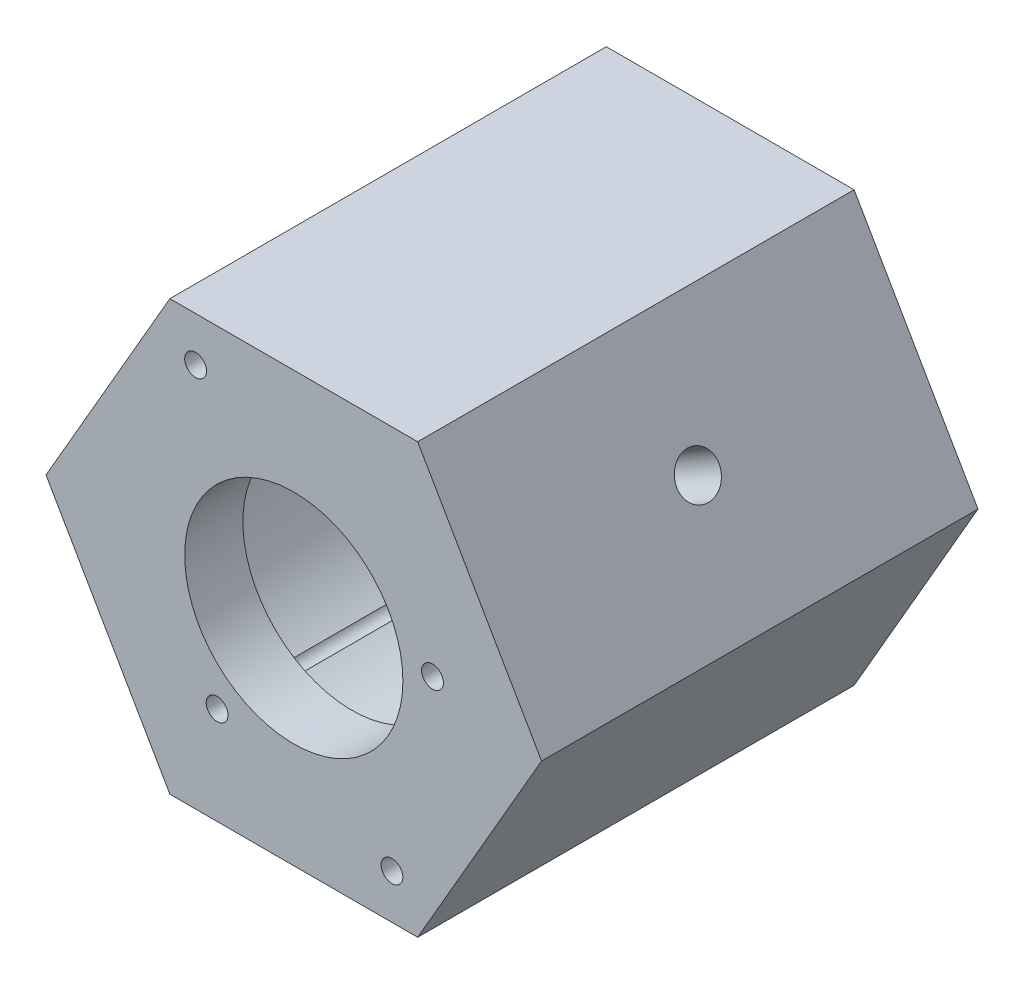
ISO-10303-21;
HEADER;
FILE_DESCRIPTION(('STEP AP214'),'2;1');
FILE_NAME('part.step','',(''),(''),'','','');
FILE_SCHEMA(('AUTOMOTIVE_DESIGN { 1 0 10303 214 1 1 1 1 }'));
ENDSEC;
DATA;
#1=APPLICATION_CONTEXT('core data for automotive mechanical design processes');
#2=APPLICATION_PROTOCOL_DEFINITION('international standard','automotive_design',2000,#1);
#3=PRODUCT_CONTEXT('',#1,'mechanical');
#4=PRODUCT('Part','Part','',(#3));
#5=PRODUCT_RELATED_PRODUCT_CATEGORY('part','',(#4));
#6=PRODUCT_DEFINITION_FORMATION('','',#4);
#7=PRODUCT_DEFINITION_CONTEXT('part definition',#1,'design');
#8=PRODUCT_DEFINITION('design','',#6,#7);
#9=PRODUCT_DEFINITION_SHAPE('','',#8);
#10=(LENGTH_UNIT() NAMED_UNIT(*) SI_UNIT(.MILLI.,.METRE.));
#11=(NAMED_UNIT(*) PLANE_ANGLE_UNIT() SI_UNIT($,.RADIAN.));
#12=(NAMED_UNIT(*) SI_UNIT($,.STERADIAN.) SOLID_ANGLE_UNIT());
#13=UNCERTAINTY_MEASURE_WITH_UNIT(LENGTH_MEASURE(1.E-05),#10,'distance_accuracy_value','');
#14=(GEOMETRIC_REPRESENTATION_CONTEXT(3) GLOBAL_UNCERTAINTY_ASSIGNED_CONTEXT((#13)) GLOBAL_UNIT_ASSIGNED_CONTEXT((#10,
#11,#12)) REPRESENTATION_CONTEXT('',''));
#15=CARTESIAN_POINT('',(0.,0.,0.));
#16=DIRECTION('',(0.,0.,1.));
#17=DIRECTION('',(1.,0.,0.));
#18=AXIS2_PLACEMENT_3D('',#15,#16,#17);
#19=CARTESIAN_POINT('',(0.,0.,30.));
#20=DIRECTION('',(0.,0.,-1.));
#21=DIRECTION('',(-1.,0.,0.));
#22=AXIS2_PLACEMENT_3D('',#19,#20,#21);
#23=CYLINDRICAL_SURFACE('',#22,20.5);
#24=DIRECTION('',(0.,0.,1.));
#25=VECTOR('',#24,1.);
#26=CARTESIAN_POINT('',(-11.928775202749,-16.6719621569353,0.));
#27=LINE('',#26,#25);
#28=CARTESIAN_POINT('',(-11.928775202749,-16.6719621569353,-30.));
#29=VERTEX_POINT('',#28);
#30=CARTESIAN_POINT('',(-11.928775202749,-16.6719621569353,22.));
#31=VERTEX_POINT('',#30);
#32=EDGE_CURVE('E47',#29,#31,#27,.T.);
#33=ORIENTED_EDGE('',*,*,#32,.F.);
#34=CARTESIAN_POINT('',(0.,0.,-30.));
#35=DIRECTION('',(0.,0.,1.));
#36=DIRECTION('',(1.,0.,0.));
#37=AXIS2_PLACEMENT_3D('',#34,#35,#36);
#38=CIRCLE('',#37,20.5);
#39=CARTESIAN_POINT('',(20.1888763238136,3.55798718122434,-30.));
#40=VERTEX_POINT('',#39);
#41=EDGE_CURVE('E122',#40,#29,#38,.T.);
#42=ORIENTED_EDGE('',*,*,#41,.F.);
#43=DIRECTION('',(0.,0.,1.));
#44=VECTOR('',#43,1.);
#45=CARTESIAN_POINT('',(20.1888763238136,3.55798718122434,0.));
#46=LINE('',#45,#44);
#47=CARTESIAN_POINT('',(20.1888763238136,3.55798718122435,22.));
#48=VERTEX_POINT('',#47);
#49=EDGE_CURVE('E323',#48,#40,#46,.F.);
#50=ORIENTED_EDGE('',*,*,#49,.F.);
#51=CARTESIAN_POINT('',(0.,0.,22.));
#52=DIRECTION('',(0.,0.,1.));
#53=DIRECTION('',(1.,0.,0.));
#54=AXIS2_PLACEMENT_3D('',#51,#52,#53);
#55=CIRCLE('',#54,20.5);
#56=EDGE_CURVE('E124',#48,#31,#55,.T.);
#57=ORIENTED_EDGE('',*,*,#56,.T.);
#58=EDGE_LOOP('',(#33,#42,#50,#57));
#59=FACE_BOUND('',#58,.T.);
#60=CARTESIAN_POINT('',(16.1249822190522,12.6583943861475,0.));
#61=CARTESIAN_POINT('',(16.1249878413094,12.6583898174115,-0.162017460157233));
#62=CARTESIAN_POINT('',(16.1334923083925,12.6475768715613,-0.324131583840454));
#63=CARTESIAN_POINT('',(16.167138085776,12.6045374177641,-0.643834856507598));
#64=CARTESIAN_POINT('',(16.1922960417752,12.5722894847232,-0.801419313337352));
#65=CARTESIAN_POINT('',(16.2580676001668,12.4871179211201,-1.10738893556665));
#66=CARTESIAN_POINT('',(16.2986698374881,12.4342094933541,-1.2557807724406));
#67=CARTESIAN_POINT('',(16.3935179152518,12.3088877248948,-1.53933958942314));
#68=CARTESIAN_POINT('',(16.447761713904,12.2364773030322,-1.67450854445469));
#69=CARTESIAN_POINT('',(16.5679837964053,12.073202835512,-1.92877222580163));
#70=CARTESIAN_POINT('',(16.6340347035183,11.9822240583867,-2.04775895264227));
#71=CARTESIAN_POINT('',(16.7749519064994,11.7841305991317,-2.265345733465));
#72=CARTESIAN_POINT('',(16.8498186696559,11.6770150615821,-2.36394470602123));
#73=CARTESIAN_POINT('',(17.0058126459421,11.4486466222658,-2.53835192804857));
#74=CARTESIAN_POINT('',(17.0869651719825,11.3273354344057,-2.61406129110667));
#75=CARTESIAN_POINT('',(17.2522555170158,11.0739574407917,-2.73990604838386));
#76=CARTESIAN_POINT('',(17.3363931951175,10.9418911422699,-2.79004264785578));
#77=CARTESIAN_POINT('',(17.5041780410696,10.6714056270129,-2.86299285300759));
#78=CARTESIAN_POINT('',(17.5878247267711,10.5330347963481,-2.88598692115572));
#79=CARTESIAN_POINT('',(17.7525494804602,10.252968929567,-2.90455930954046));
#80=CARTESIAN_POINT('',(17.833627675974,10.1112740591,-2.90013899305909));
#81=CARTESIAN_POINT('',(17.9903615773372,9.82968366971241,-2.86415129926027));
#82=CARTESIAN_POINT('',(18.0660518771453,9.68978252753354,-2.83277804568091));
#83=CARTESIAN_POINT('',(18.2108269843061,9.41487816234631,-2.74407930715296));
#84=CARTESIAN_POINT('',(18.2799116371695,9.27987505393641,-2.68675321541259));
#85=CARTESIAN_POINT('',(18.4103280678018,9.01838472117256,-2.54757457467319));
#86=CARTESIAN_POINT('',(18.4716327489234,8.89192794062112,-2.46563947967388));
#87=CARTESIAN_POINT('',(18.5852619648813,8.65191867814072,-2.27962885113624));
#88=CARTESIAN_POINT('',(18.6375859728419,8.53836695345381,-2.17555201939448));
#89=CARTESIAN_POINT('',(18.7330641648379,8.3268193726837,-1.94712871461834));
#90=CARTESIAN_POINT('',(18.776134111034,8.22896831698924,-1.82261285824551));
#91=CARTESIAN_POINT('',(18.8521626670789,8.05326990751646,-1.5574238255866));
#92=CARTESIAN_POINT('',(18.8851212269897,7.97542265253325,-1.41675056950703));
#93=CARTESIAN_POINT('',(18.9407633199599,7.84236664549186,-1.12307451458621));
#94=CARTESIAN_POINT('',(18.9634402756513,7.7871723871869,-0.970063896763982));
#95=CARTESIAN_POINT('',(18.9984041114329,7.70148058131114,-0.65614503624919));
#96=CARTESIAN_POINT('',(19.0106916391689,7.67098149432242,-0.495237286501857));
#97=CARTESIAN_POINT('',(19.0247868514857,7.63595732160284,-0.171578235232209));
#98=CARTESIAN_POINT('',(19.0266840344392,7.63121041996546,-0.00885481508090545));
#99=CARTESIAN_POINT('',(19.0202352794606,7.64726891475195,0.315117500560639));
#100=CARTESIAN_POINT('',(19.0118896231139,7.66807360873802,0.476366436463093));
#101=CARTESIAN_POINT('',(18.985034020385,7.73432210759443,0.792087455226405));
#102=CARTESIAN_POINT('',(18.9665690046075,7.77965698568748,0.946586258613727));
#103=CARTESIAN_POINT('',(18.9195609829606,7.89328640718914,1.24526157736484));
#104=CARTESIAN_POINT('',(18.8910175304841,7.96158196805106,1.38943763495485));
#105=CARTESIAN_POINT('',(18.8237562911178,8.11933329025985,1.66444012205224));
#106=CARTESIAN_POINT('',(18.7849714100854,8.20892818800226,1.79517031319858));
#107=CARTESIAN_POINT('',(18.6975874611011,8.40605843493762,2.03858346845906));
#108=CARTESIAN_POINT('',(18.6489879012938,8.51359468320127,2.15126552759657));
#109=CARTESIAN_POINT('',(18.5420714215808,8.74401543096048,2.35622766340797));
#110=CARTESIAN_POINT('',(18.483685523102,8.86700720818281,2.44835125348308));
#111=CARTESIAN_POINT('',(18.3582809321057,9.12381010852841,2.60849385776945));
#112=CARTESIAN_POINT('',(18.2912624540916,9.25762096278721,2.67651347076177));
#113=CARTESIAN_POINT('',(18.1500746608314,9.53144366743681,2.78626421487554));
#114=CARTESIAN_POINT('',(18.0759300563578,9.67143323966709,2.82808266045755));
#115=CARTESIAN_POINT('',(17.9220043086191,9.95377303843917,2.88452714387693));
#116=CARTESIAN_POINT('',(17.8422234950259,10.0961231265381,2.89915477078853));
#117=CARTESIAN_POINT('',(17.6798971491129,10.3777369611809,2.90076689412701));
#118=CARTESIAN_POINT('',(17.5973818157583,10.5170168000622,2.88799148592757));
#119=CARTESIAN_POINT('',(17.4314146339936,10.7898698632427,2.83567260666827));
#120=CARTESIAN_POINT('',(17.3479627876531,10.9234431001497,2.7961291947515));
#121=CARTESIAN_POINT('',(17.1829146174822,11.181273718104,2.69147853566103));
#122=CARTESIAN_POINT('',(17.1013172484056,11.3055364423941,2.62638608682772));
#123=CARTESIAN_POINT('',(16.9427898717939,11.5417559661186,2.47251032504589));
#124=CARTESIAN_POINT('',(16.8658599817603,11.6537124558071,2.38372641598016));
#125=CARTESIAN_POINT('',(16.7189091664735,11.8635850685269,2.18411221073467));
#126=CARTESIAN_POINT('',(16.6489512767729,11.9613761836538,2.0731040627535));
#127=CARTESIAN_POINT('',(16.5194494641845,12.1396028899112,1.83256600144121));
#128=CARTESIAN_POINT('',(16.4599079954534,12.2200343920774,1.70303173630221));
#129=CARTESIAN_POINT('',(16.3534923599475,12.3620883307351,1.42836746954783));
#130=CARTESIAN_POINT('',(16.3066825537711,12.4236153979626,1.283163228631));
#131=CARTESIAN_POINT('',(16.2282530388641,12.5258929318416,0.981870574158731));
#132=CARTESIAN_POINT('',(16.1966172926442,12.5666653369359,0.825793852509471));
#133=CARTESIAN_POINT('',(16.1572956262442,12.6171487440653,0.557479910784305));
#134=CARTESIAN_POINT('',(16.1452050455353,12.6325978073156,0.44691349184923));
#135=CARTESIAN_POINT('',(16.1290464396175,12.6532221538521,0.224246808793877));
#136=CARTESIAN_POINT('',(16.1249783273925,12.6583975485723,0.112146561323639));
#137=CARTESIAN_POINT('',(16.1249822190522,12.6583943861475,0.));
#138=B_SPLINE_CURVE_WITH_KNOTS('',3,(#60,#61,#62,#63,#64,#65,#66,#67,#68,#69,#70,#71,#72,#73,
#74,#75,#76,#77,#78,#79,#80,#81,#82,#83,#84,#85,#86,#87,#88,#89,#90,#91,#92,#93,#94,#95,#96,#97,
#98,#99,#100,#101,#102,#103,#104,#105,#106,#107,#108,#109,#110,#111,#112,#113,#114,#115,#116,
#117,#118,#119,#120,#121,#122,#123,#124,#125,#126,#127,#128,#129,#130,#131,#132,#133,#134,#135,
#136,#137),.UNSPECIFIED.,.T.,.F.,(4,2,2,2,2,2,2,2,2,2,2,2,2,2,2,2,2,2,2,2,2,2,2,2,2,2,2,2,2,2,2,
2,2,2,2,2,2,2,4),(0.,0.485642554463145,0.971771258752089,1.45754292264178,1.94324192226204,
2.43203815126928,2.92086030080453,3.41176501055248,3.90264658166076,4.39024571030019,
4.87782059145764,5.36191296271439,5.84601665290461,6.33176266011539,6.81753715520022,
7.30756197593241,7.79758921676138,8.28792949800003,8.77823921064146,9.2643188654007,
9.75038515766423,10.2343105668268,10.7182574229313,11.205456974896,11.692680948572,
12.1834958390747,12.6742985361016,13.1634568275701,13.6525865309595,14.1374481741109,
14.6223087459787,15.1068888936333,15.5914812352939,16.0801188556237,16.5688714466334,
17.0600506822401,17.5507096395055,17.8868692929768,18.2230253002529),.UNSPECIFIED.);
#139=CARTESIAN_POINT('',(16.1249822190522,12.6583943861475,0.));
#140=VERTEX_POINT('',#139);
#141=EDGE_CURVE('E181',#140,#140,#138,.T.);
#142=ORIENTED_EDGE('',*,*,#141,.F.);
#143=EDGE_LOOP('',(#142));
#144=FACE_BOUND('',#143,.T.);
#145=CARTESIAN_POINT('',(-19.0249822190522,-7.63544704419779,0.));
#146=CARTESIAN_POINT('',(-19.0249810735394,-7.63545419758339,0.162017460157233));
#147=CARTESIAN_POINT('',(-19.0198690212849,-7.6482257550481,0.324131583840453));
#148=CARTESIAN_POINT('',(-18.9994186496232,-7.6988835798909,0.643834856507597));
#149=CARTESIAN_POINT('',(-18.9840700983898,-7.7367949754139,0.801419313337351));
#150=CARTESIAN_POINT('',(-18.9431951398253,-7.83634059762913,1.10738893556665));
#151=CARTESIAN_POINT('',(-18.9176762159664,-7.8979573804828,1.2557807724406));
#152=CARTESIAN_POINT('',(-18.8565684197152,-8.04275910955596,1.53933958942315));
#153=CARTESIAN_POINT('',(-18.8209810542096,-8.12594082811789,1.67450854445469));
#154=CARTESIAN_POINT('',(-18.7396922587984,-8.3116934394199,1.92877222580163));
#155=CARTESIAN_POINT('',(-18.6939277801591,-8.41438459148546,2.04775895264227));
#156=CARTESIAN_POINT('',(-18.5928324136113,-8.63546919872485,2.265345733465));
#157=CARTESIAN_POINT('',(-18.5375010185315,-8.75386348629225,2.36394470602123));
#158=CARTESIAN_POINT('',(-18.4177251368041,-9.00314245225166,2.53835192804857));
#159=CARTESIAN_POINT('',(-18.3532428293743,-9.13407819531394,2.61406129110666));
#160=CARTESIAN_POINT('',(-18.2164562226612,-9.40391282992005,2.73990604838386));
#161=CARTESIAN_POINT('',(-18.1441522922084,-9.54281134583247,2.79004264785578));
#162=CARTESIAN_POINT('',(-17.9937973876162,-9.82336004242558,2.86299285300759));
#163=CARTESIAN_POINT('',(-17.9157880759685,-9.96498561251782,2.88598692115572));
#164=CARTESIAN_POINT('',(-17.7556062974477,-10.2476743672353,2.90455930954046));
#165=CARTESIAN_POINT('',(-17.6734340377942,-10.3887375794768,2.90013899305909));
#166=CARTESIAN_POINT('',(-17.5079365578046,-10.6652683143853,2.86415129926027));
#167=CARTESIAN_POINT('',(-17.4246237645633,-10.8007686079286,2.83277804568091));
#168=CARTESIAN_POINT('',(-17.2589371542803,-11.0635997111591,2.74407930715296));
#169=CARTESIAN_POINT('',(-17.1765633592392,-11.1909303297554,2.68675321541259));
#170=CARTESIAN_POINT('',(-17.0153143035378,-11.4346194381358,2.54757457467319));
#171=CARTESIAN_POINT('',(-16.9364518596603,-11.5509392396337,2.46563947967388));
#172=CARTESIAN_POINT('',(-16.7854123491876,-11.7693496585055,2.27962885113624));
#173=CARTESIAN_POINT('',(-16.7132356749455,-11.8714394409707,2.17555201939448));
#174=CARTESIAN_POINT('',(-16.5777691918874,-12.0598997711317,1.94712871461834));
#175=CARTESIAN_POINT('',(-16.5145626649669,-12.1461249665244,1.82261285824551));
#176=CARTESIAN_POINT('',(-16.4004176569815,-12.2998168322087,1.5574238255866));
#177=CARTESIAN_POINT('',(-16.3494792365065,-12.3672834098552,1.41675056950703));
#178=CARTESIAN_POINT('',(-16.2620704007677,-12.4819988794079,1.12307451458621));
#179=CARTESIAN_POINT('',(-16.2256092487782,-12.5292348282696,0.970063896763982));
#180=CARTESIAN_POINT('',(-16.1688798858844,-12.6023603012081,0.65614503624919));
#181=CARTESIAN_POINT('',(-16.148610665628,-12.6282511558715,0.495237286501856));
#182=CARTESIAN_POINT('',(-16.1253264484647,-12.6579700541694,0.171578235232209));
#183=CARTESIAN_POINT('',(-16.1221641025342,-12.6619865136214,0.00885481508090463));
#184=CARTESIAN_POINT('',(-16.1328467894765,-12.6483724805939,-0.31511750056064));
#185=CARTESIAN_POINT('',(-16.1466913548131,-12.6307425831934,-0.476366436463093));
#186=CARTESIAN_POINT('',(-16.1906364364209,-12.574360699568,-0.792087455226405));
#187=CARTESIAN_POINT('',(-16.2206650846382,-12.5357020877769,-0.946586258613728));
#188=CARTESIAN_POINT('',(-16.2955670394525,-12.4381772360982,-1.24526157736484));
#189=CARTESIAN_POINT('',(-16.3404410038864,-12.3793101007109,-1.38943763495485));
#190=CARTESIAN_POINT('',(-16.4434270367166,-12.2421844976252,-1.66444012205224));
#191=CARTESIAN_POINT('',(-16.5016260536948,-12.1637983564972,-1.79517031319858));
#192=CARTESIAN_POINT('',(-16.628653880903,-11.9895565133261,-2.03858346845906));
#193=CARTESIAN_POINT('',(-16.6974832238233,-11.8936999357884,-2.15126552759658));
#194=CARTESIAN_POINT('',(-16.8435752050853,-11.6858971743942,-2.35622766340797));
#195=CARTESIAN_POINT('',(-16.920896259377,-11.5738376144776,-2.44835125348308));
#196=CARTESIAN_POINT('',(-17.0805917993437,-11.3368326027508,-2.60849385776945));
#197=CARTESIAN_POINT('',(-17.1629661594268,-11.2118874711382,-2.67651347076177));
#198=CARTESIAN_POINT('',(-17.3295096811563,-10.9527039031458,-2.78626421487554));
#199=CARTESIAN_POINT('',(-17.4136719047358,-10.818498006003,-2.82808266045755));
#200=CARTESIAN_POINT('',(-17.5812224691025,-10.5440244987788,-2.88452714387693));
#201=CARTESIAN_POINT('',(-17.6646108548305,-10.4037572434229,-2.89915477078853));
#202=CARTESIAN_POINT('',(-17.8273324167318,-10.1223715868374,-2.90076689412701));
#203=CARTESIAN_POINT('',(-17.9066946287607,-9.98127129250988,-2.88799148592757));
#204=CARTESIAN_POINT('',(-18.0600087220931,-9.7011129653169,-2.83567260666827));
#205=CARTESIAN_POINT('',(-18.13396061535,-9.56205492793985,-2.7961291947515));
#206=CARTESIAN_POINT('',(-18.2747243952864,-9.2902037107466,-2.69147853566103));
#207=CARTESIAN_POINT('',(-18.3415403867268,-9.15740695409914,-2.62638608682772));
#208=CARTESIAN_POINT('',(-18.4668488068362,-8.90200845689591,-2.47251032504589));
#209=CARTESIAN_POINT('',(-18.5253410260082,-8.77940697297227,-2.38372641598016));
#210=CARTESIAN_POINT('',(-18.6336206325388,-8.54720752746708,-2.18411221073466));
#211=CARTESIAN_POINT('',(-18.6833312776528,-8.43772666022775,-2.0731040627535));
#212=CARTESIAN_POINT('',(-18.7729292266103,-8.23646144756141,-1.83256600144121));
#213=CARTESIAN_POINT('',(-18.8128142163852,-8.14468127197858,-1.70303173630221));
#214=CARTESIAN_POINT('',(-18.8826287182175,-7.98149565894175,-1.42836746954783));
#215=CARTESIAN_POINT('',(-18.9125078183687,-7.91019364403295,-1.283163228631));
#216=CARTESIAN_POINT('',(-18.9618680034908,-7.79113292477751,-0.981870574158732));
#217=CARTESIAN_POINT('',(-18.9813600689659,-7.74334936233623,-0.82579385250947));
#218=CARTESIAN_POINT('',(-19.0054191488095,-7.68405409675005,-0.557479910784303));
#219=CARTESIAN_POINT('',(-19.0127531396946,-7.66585881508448,-0.446913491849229));
#220=CARTESIAN_POINT('',(-19.0225350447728,-7.64155287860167,-0.224246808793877));
#221=CARTESIAN_POINT('',(-19.0249830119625,-7.63544209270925,-0.112146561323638));
#222=CARTESIAN_POINT('',(-19.0249822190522,-7.63544704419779,0.));
#223=B_SPLINE_CURVE_WITH_KNOTS('',3,(#145,#146,#147,#148,#149,#150,#151,#152,#153,#154,#155,
#156,#157,#158,#159,#160,#161,#162,#163,#164,#165,#166,#167,#168,#169,#170,#171,#172,#173,#174,
#175,#176,#177,#178,#179,#180,#181,#182,#183,#184,#185,#186,#187,#188,#189,#190,#191,#192,#193,
#194,#195,#196,#197,#198,#199,#200,#201,#202,#203,#204,#205,#206,#207,#208,#209,#210,#211,#212,
#213,#214,#215,#216,#217,#218,#219,#220,#221,#222),.UNSPECIFIED.,.T.,.F.,(4,2,2,2,2,2,2,2,2,2,2,
2,2,2,2,2,2,2,2,2,2,2,2,2,2,2,2,2,2,2,2,2,2,2,2,2,2,2,4),(0.,0.485642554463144,
0.971771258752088,1.45754292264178,1.94324192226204,2.43203815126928,2.92086030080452,
3.41176501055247,3.90264658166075,4.39024571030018,4.87782059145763,5.36191296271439,
5.84601665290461,6.33176266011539,6.81753715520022,7.30756197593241,7.79758921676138,
8.28792949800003,8.77823921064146,9.2643188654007,9.75038515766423,10.2343105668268,
10.7182574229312,11.205456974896,11.692680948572,12.1834958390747,12.6742985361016,
13.1634568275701,13.6525865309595,14.1374481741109,14.6223087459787,15.1068888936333,
15.5914812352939,16.0801188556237,16.5688714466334,17.0600506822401,17.5507096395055,
17.8868692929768,18.2230253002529),.UNSPECIFIED.);
#224=CARTESIAN_POINT('',(-19.0249822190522,-7.63544704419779,0.));
#225=VERTEX_POINT('',#224);
#226=EDGE_CURVE('E188',#225,#225,#223,.T.);
#227=ORIENTED_EDGE('',*,*,#226,.F.);
#228=EDGE_LOOP('',(#227));
#229=FACE_BOUND('',#228,.T.);
#230=ADVANCED_FACE('F32',(#59,#144,#229),#23,.F.);
#231=DIRECTION('',(0.,0.,1.));
#232=VECTOR('',#231,1.);
#233=CARTESIAN_POINT('',(-10.5186195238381,-17.5956995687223,0.));
#234=LINE('',#233,#232);
#235=CARTESIAN_POINT('',(-10.5186195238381,-17.5956995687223,22.));
#236=VERTEX_POINT('',#235);
#237=CARTESIAN_POINT('',(-10.5186195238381,-17.5956995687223,-30.));
#238=VERTEX_POINT('',#237);
#239=EDGE_CURVE('E111',#236,#238,#234,.F.);
#240=ORIENTED_EDGE('',*,*,#239,.F.);
#241=CARTESIAN_POINT('',(20.4129512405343,1.88717292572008,22.));
#242=VERTEX_POINT('',#241);
#243=EDGE_CURVE('E54',#236,#242,#55,.T.);
#244=ORIENTED_EDGE('',*,*,#243,.T.);
#245=DIRECTION('',(0.,0.,1.));
#246=VECTOR('',#245,1.);
#247=CARTESIAN_POINT('',(20.4129512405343,1.88717292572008,0.));
#248=LINE('',#247,#246);
#249=CARTESIAN_POINT('',(20.4129512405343,1.88717292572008,-30.));
#250=VERTEX_POINT('',#249);
#251=EDGE_CURVE('E247',#250,#242,#248,.T.);
#252=ORIENTED_EDGE('',*,*,#251,.F.);
#253=EDGE_CURVE('E132',#238,#250,#38,.T.);
#254=ORIENTED_EDGE('',*,*,#253,.F.);
#255=EDGE_LOOP('',(#240,#244,#252,#254));
#256=FACE_BOUND('',#255,.T.);
#257=ADVANCED_FACE('F193',(#256),#23,.F.);
#258=CARTESIAN_POINT('',(0.,0.,30.));
#259=DIRECTION('',(0.,0.,1.));
#260=DIRECTION('',(1.,0.,0.));
#261=AXIS2_PLACEMENT_3D('',#258,#259,#260);
#262=PLANE('',#261);
#263=CARTESIAN_POINT('',(-13.5,23.3826859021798,30.));
#264=DIRECTION('',(0.,0.,-1.));
#265=DIRECTION('',(1.,0.,0.));
#266=AXIS2_PLACEMENT_3D('',#263,#264,#265);
#267=CIRCLE('',#266,1.5);
#268=CARTESIAN_POINT('',(-12.,23.3826859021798,30.));
#269=VERTEX_POINT('',#268);
#270=EDGE_CURVE('E312',#269,#269,#267,.T.);
#271=ORIENTED_EDGE('',*,*,#270,.T.);
#272=EDGE_LOOP('',(#271));
#273=FACE_BOUND('',#272,.T.);
#274=CARTESIAN_POINT('',(13.5,-23.3826859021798,30.));
#275=DIRECTION('',(0.,0.,-1.));
#276=DIRECTION('',(-1.,0.,0.));
#277=AXIS2_PLACEMENT_3D('',#274,#275,#276);
#278=CIRCLE('',#277,1.5);
#279=CARTESIAN_POINT('',(12.,-23.3826859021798,30.));
#280=VERTEX_POINT('',#279);
#281=EDGE_CURVE('E311',#280,#280,#278,.T.);
#282=ORIENTED_EDGE('',*,*,#281,.T.);
#283=EDGE_LOOP('',(#282));
#284=FACE_BOUND('',#283,.T.);
#285=CARTESIAN_POINT('',(-10.5437968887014,-16.0959108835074,30.));
#286=DIRECTION('',(0.,0.,1.));
#287=DIRECTION('',(1.,0.,0.));
#288=AXIS2_PLACEMENT_3D('',#285,#286,#287);
#289=CIRCLE('',#288,1.5);
#290=CARTESIAN_POINT('',(-9.04379688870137,-16.0959108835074,30.));
#291=VERTEX_POINT('',#290);
#292=EDGE_CURVE('E115',#291,#291,#289,.T.);
#293=ORIENTED_EDGE('',*,*,#292,.F.);
#294=EDGE_LOOP('',(#293));
#295=FACE_BOUND('',#294,.T.);
#296=CARTESIAN_POINT('',(19.071140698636,2.55765370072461,30.));
#297=DIRECTION('',(0.,0.,1.));
#298=DIRECTION('',(-1.,0.,0.));
#299=AXIS2_PLACEMENT_3D('',#296,#297,#298);
#300=CIRCLE('',#299,1.5);
#301=CARTESIAN_POINT('',(17.571140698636,2.55765370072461,30.));
#302=VERTEX_POINT('',#301);
#303=EDGE_CURVE('E125',#302,#302,#300,.T.);
#304=ORIENTED_EDGE('',*,*,#303,.F.);
#305=EDGE_LOOP('',(#304));
#306=FACE_BOUND('',#305,.T.);
#307=DIRECTION('',(-0.5,-0.866025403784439,0.));
#308=VECTOR('',#307,1.);
#309=CARTESIAN_POINT('',(-17.031832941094,29.5,30.));
#310=LINE('',#309,#308);
#311=CARTESIAN_POINT('',(-17.031832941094,29.5,30.));
#312=VERTEX_POINT('',#311);
#313=CARTESIAN_POINT('',(-34.0636658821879,0.,30.));
#314=VERTEX_POINT('',#313);
#315=EDGE_CURVE('E141',#312,#314,#310,.T.);
#316=ORIENTED_EDGE('',*,*,#315,.T.);
#317=DIRECTION('',(0.5,-0.866025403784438,0.));
#318=VECTOR('',#317,1.);
#319=CARTESIAN_POINT('',(-34.0636658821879,0.,30.));
#320=LINE('',#319,#318);
#321=CARTESIAN_POINT('',(-17.031832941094,-29.5,30.));
#322=VERTEX_POINT('',#321);
#323=EDGE_CURVE('E144',#314,#322,#320,.T.);
#324=ORIENTED_EDGE('',*,*,#323,.T.);
#325=DIRECTION('',(1.,0.,0.));
#326=VECTOR('',#325,1.);
#327=CARTESIAN_POINT('',(-17.031832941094,-29.5,30.));
#328=LINE('',#327,#326);
#329=CARTESIAN_POINT('',(17.031832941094,-29.5,30.));
#330=VERTEX_POINT('',#329);
#331=EDGE_CURVE('E147',#322,#330,#328,.T.);
#332=ORIENTED_EDGE('',*,*,#331,.T.);
#333=DIRECTION('',(0.5,0.866025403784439,0.));
#334=VECTOR('',#333,1.);
#335=CARTESIAN_POINT('',(17.031832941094,-29.5,30.));
#336=LINE('',#335,#334);
#337=CARTESIAN_POINT('',(34.0636658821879,0.,30.));
#338=VERTEX_POINT('',#337);
#339=EDGE_CURVE('E149',#330,#338,#336,.T.);
#340=ORIENTED_EDGE('',*,*,#339,.T.);
#341=DIRECTION('',(-0.5,0.866025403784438,0.));
#342=VECTOR('',#341,1.);
#343=CARTESIAN_POINT('',(34.0636658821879,0.,30.));
#344=LINE('',#343,#342);
#345=CARTESIAN_POINT('',(17.031832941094,29.5,30.));
#346=VERTEX_POINT('',#345);
#347=EDGE_CURVE('E151',#338,#346,#344,.T.);
#348=ORIENTED_EDGE('',*,*,#347,.T.);
#349=DIRECTION('',(-1.,0.,0.));
#350=VECTOR('',#349,1.);
#351=CARTESIAN_POINT('',(17.031832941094,29.5,30.));
#352=LINE('',#351,#350);
#353=EDGE_CURVE('E153',#346,#312,#352,.T.);
#354=ORIENTED_EDGE('',*,*,#353,.T.);
#355=EDGE_LOOP('',(#316,#324,#332,#340,#348,#354));
#356=FACE_BOUND('',#355,.T.);
#357=CARTESIAN_POINT('',(0.,0.,30.));
#358=DIRECTION('',(0.,0.,1.));
#359=DIRECTION('',(1.,0.,0.));
#360=AXIS2_PLACEMENT_3D('',#357,#358,#359);
#361=CIRCLE('',#360,15.);
#362=CARTESIAN_POINT('',(15.,0.,30.));
#363=VERTEX_POINT('',#362);
#364=EDGE_CURVE('E243',#363,#363,#361,.T.);
#365=ORIENTED_EDGE('',*,*,#364,.F.);
#366=EDGE_LOOP('',(#365));
#367=FACE_BOUND('',#366,.T.);
#368=ADVANCED_FACE('F233',(#273,#284,#295,#306,#356,#367),#262,.T.);
#369=CARTESIAN_POINT('',(0.,0.,-30.));
#370=DIRECTION('',(0.,0.,1.));
#371=DIRECTION('',(1.,0.,0.));
#372=AXIS2_PLACEMENT_3D('',#369,#370,#371);
#373=PLANE('',#372);
#374=CARTESIAN_POINT('',(-13.5,23.3826859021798,-30.));
#375=DIRECTION('',(0.,0.,-1.));
#376=DIRECTION('',(1.,0.,0.));
#377=AXIS2_PLACEMENT_3D('',#374,#375,#376);
#378=CIRCLE('',#377,1.5);
#379=CARTESIAN_POINT('',(-12.,23.3826859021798,-30.));
#380=VERTEX_POINT('',#379);
#381=EDGE_CURVE('E306',#380,#380,#378,.T.);
#382=ORIENTED_EDGE('',*,*,#381,.F.);
#383=EDGE_LOOP('',(#382));
#384=FACE_BOUND('',#383,.T.);
#385=CARTESIAN_POINT('',(13.5,-23.3826859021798,-30.));
#386=DIRECTION('',(0.,0.,-1.));
#387=DIRECTION('',(-1.,0.,0.));
#388=AXIS2_PLACEMENT_3D('',#385,#386,#387);
#389=CIRCLE('',#388,1.5);
#390=CARTESIAN_POINT('',(12.,-23.3826859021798,-30.));
#391=VERTEX_POINT('',#390);
#392=EDGE_CURVE('E309',#391,#391,#389,.T.);
#393=ORIENTED_EDGE('',*,*,#392,.F.);
#394=EDGE_LOOP('',(#393));
#395=FACE_BOUND('',#394,.T.);
#396=DIRECTION('',(-0.5,-0.866025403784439,0.));
#397=VECTOR('',#396,1.);
#398=CARTESIAN_POINT('',(-17.031832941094,29.5,-30.));
#399=LINE('',#398,#397);
#400=CARTESIAN_POINT('',(-17.031832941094,29.5,-30.));
#401=VERTEX_POINT('',#400);
#402=CARTESIAN_POINT('',(-34.0636658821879,0.,-30.));
#403=VERTEX_POINT('',#402);
#404=EDGE_CURVE('E131',#401,#403,#399,.T.);
#405=ORIENTED_EDGE('',*,*,#404,.F.);
#406=DIRECTION('',(-1.,0.,0.));
#407=VECTOR('',#406,1.);
#408=CARTESIAN_POINT('',(17.031832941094,29.5,-30.));
#409=LINE('',#408,#407);
#410=CARTESIAN_POINT('',(17.031832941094,29.5,-30.));
#411=VERTEX_POINT('',#410);
#412=EDGE_CURVE('E145',#411,#401,#409,.T.);
#413=ORIENTED_EDGE('',*,*,#412,.F.);
#414=DIRECTION('',(-0.5,0.866025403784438,0.));
#415=VECTOR('',#414,1.);
#416=CARTESIAN_POINT('',(34.0636658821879,0.,-30.));
#417=LINE('',#416,#415);
#418=CARTESIAN_POINT('',(34.0636658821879,0.,-30.));
#419=VERTEX_POINT('',#418);
#420=EDGE_CURVE('E161',#419,#411,#417,.T.);
#421=ORIENTED_EDGE('',*,*,#420,.F.);
#422=DIRECTION('',(0.5,0.866025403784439,0.));
#423=VECTOR('',#422,1.);
#424=CARTESIAN_POINT('',(17.031832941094,-29.5,-30.));
#425=LINE('',#424,#423);
#426=CARTESIAN_POINT('',(17.031832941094,-29.5,-30.));
#427=VERTEX_POINT('',#426);
#428=EDGE_CURVE('E159',#427,#419,#425,.T.);
#429=ORIENTED_EDGE('',*,*,#428,.F.);
#430=DIRECTION('',(1.,0.,0.));
#431=VECTOR('',#430,1.);
#432=CARTESIAN_POINT('',(-17.031832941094,-29.5,-30.));
#433=LINE('',#432,#431);
#434=CARTESIAN_POINT('',(-17.031832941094,-29.5,-30.));
#435=VERTEX_POINT('',#434);
#436=EDGE_CURVE('E157',#435,#427,#433,.T.);
#437=ORIENTED_EDGE('',*,*,#436,.F.);
#438=DIRECTION('',(0.5,-0.866025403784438,0.));
#439=VECTOR('',#438,1.);
#440=CARTESIAN_POINT('',(-34.0636658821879,0.,-30.));
#441=LINE('',#440,#439);
#442=EDGE_CURVE('E135',#403,#435,#441,.T.);
#443=ORIENTED_EDGE('',*,*,#442,.F.);
#444=EDGE_LOOP('',(#405,#413,#421,#429,#437,#443));
#445=FACE_BOUND('',#444,.T.);
#446=ORIENTED_EDGE('',*,*,#41,.T.);
#447=CARTESIAN_POINT('',(-10.5437968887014,-16.0959108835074,-30.));
#448=DIRECTION('',(0.,0.,1.));
#449=DIRECTION('',(1.,0.,0.));
#450=AXIS2_PLACEMENT_3D('',#447,#448,#449);
#451=CIRCLE('',#450,1.5);
#452=EDGE_CURVE('E108',#29,#238,#451,.T.);
#453=ORIENTED_EDGE('',*,*,#452,.T.);
#454=ORIENTED_EDGE('',*,*,#253,.T.);
#455=CARTESIAN_POINT('',(19.071140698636,2.55765370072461,-30.));
#456=DIRECTION('',(0.,0.,1.));
#457=DIRECTION('',(-1.,0.,0.));
#458=AXIS2_PLACEMENT_3D('',#455,#456,#457);
#459=CIRCLE('',#458,1.5);
#460=EDGE_CURVE('E130',#250,#40,#459,.T.);
#461=ORIENTED_EDGE('',*,*,#460,.T.);
#462=EDGE_LOOP('',(#446,#453,#454,#461));
#463=FACE_BOUND('',#462,.T.);
#464=ADVANCED_FACE('F128',(#384,#395,#445,#463),#373,.F.);
#465=CARTESIAN_POINT('',(-17.031832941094,29.5,30.));
#466=DIRECTION('',(0.866025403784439,-0.5,0.));
#467=DIRECTION('',(0.5,0.866025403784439,0.));
#468=AXIS2_PLACEMENT_3D('',#465,#466,#467);
#469=PLANE('',#468);
#470=ORIENTED_EDGE('',*,*,#404,.T.);
#471=DIRECTION('',(0.,0.,-1.));
#472=VECTOR('',#471,1.);
#473=CARTESIAN_POINT('',(-34.0636658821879,0.,30.));
#474=LINE('',#473,#472);
#475=EDGE_CURVE('E178',#314,#403,#474,.T.);
#476=ORIENTED_EDGE('',*,*,#475,.F.);
#477=ORIENTED_EDGE('',*,*,#315,.F.);
#478=DIRECTION('',(0.,0.,-1.));
#479=VECTOR('',#478,1.);
#480=CARTESIAN_POINT('',(-17.031832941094,29.5,30.));
#481=LINE('',#480,#479);
#482=EDGE_CURVE('E154',#312,#401,#481,.T.);
#483=ORIENTED_EDGE('',*,*,#482,.T.);
#484=EDGE_LOOP('',(#470,#476,#477,#483));
#485=FACE_BOUND('',#484,.T.);
#486=ADVANCED_FACE('F34',(#485),#469,.F.);
#487=CARTESIAN_POINT('',(-34.0636658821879,0.,30.));
#488=DIRECTION('',(0.866025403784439,0.5,0.));
#489=DIRECTION('',(-0.5,0.866025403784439,0.));
#490=AXIS2_PLACEMENT_3D('',#487,#488,#489);
#491=PLANE('',#490);
#492=CARTESIAN_POINT('',(-25.5477494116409,-14.75,0.));
#493=DIRECTION('',(0.866025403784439,0.5,0.));
#494=DIRECTION('',(-0.5,0.866025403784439,0.));
#495=AXIS2_PLACEMENT_3D('',#492,#493,#494);
#496=CIRCLE('',#495,2.9);
#497=CARTESIAN_POINT('',(-26.9977494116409,-12.2385263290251,0.));
#498=VERTEX_POINT('',#497);
#499=EDGE_CURVE('E137',#498,#498,#496,.T.);
#500=ORIENTED_EDGE('',*,*,#499,.T.);
#501=EDGE_LOOP('',(#500));
#502=FACE_BOUND('',#501,.T.);
#503=ORIENTED_EDGE('',*,*,#442,.T.);
#504=DIRECTION('',(0.,0.,-1.));
#505=VECTOR('',#504,1.);
#506=CARTESIAN_POINT('',(-17.031832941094,-29.5,30.));
#507=LINE('',#506,#505);
#508=EDGE_CURVE('E175',#322,#435,#507,.T.);
#509=ORIENTED_EDGE('',*,*,#508,.F.);
#510=ORIENTED_EDGE('',*,*,#323,.F.);
#511=ORIENTED_EDGE('',*,*,#475,.T.);
#512=EDGE_LOOP('',(#503,#509,#510,#511));
#513=FACE_BOUND('',#512,.T.);
#514=ADVANCED_FACE('F285',(#502,#513),#491,.F.);
#515=CARTESIAN_POINT('',(-17.031832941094,-29.5,30.));
#516=DIRECTION('',(0.,1.,0.));
#517=DIRECTION('',(-1.,0.,0.));
#518=AXIS2_PLACEMENT_3D('',#515,#516,#517);
#519=PLANE('',#518);
#520=ORIENTED_EDGE('',*,*,#436,.T.);
#521=DIRECTION('',(0.,0.,-1.));
#522=VECTOR('',#521,1.);
#523=CARTESIAN_POINT('',(17.031832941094,-29.5,30.));
#524=LINE('',#523,#522);
#525=EDGE_CURVE('E172',#330,#427,#524,.T.);
#526=ORIENTED_EDGE('',*,*,#525,.F.);
#527=ORIENTED_EDGE('',*,*,#331,.F.);
#528=ORIENTED_EDGE('',*,*,#508,.T.);
#529=EDGE_LOOP('',(#520,#526,#527,#528));
#530=FACE_BOUND('',#529,.T.);
#531=ADVANCED_FACE('F283',(#530),#519,.F.);
#532=CARTESIAN_POINT('',(17.031832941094,-29.5,30.));
#533=DIRECTION('',(-0.866025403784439,0.5,0.));
#534=DIRECTION('',(-0.5,-0.866025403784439,0.));
#535=AXIS2_PLACEMENT_3D('',#532,#533,#534);
#536=PLANE('',#535);
#537=ORIENTED_EDGE('',*,*,#428,.T.);
#538=DIRECTION('',(0.,0.,-1.));
#539=VECTOR('',#538,1.);
#540=CARTESIAN_POINT('',(34.0636658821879,0.,30.));
#541=LINE('',#540,#539);
#542=EDGE_CURVE('E169',#338,#419,#541,.T.);
#543=ORIENTED_EDGE('',*,*,#542,.F.);
#544=ORIENTED_EDGE('',*,*,#339,.F.);
#545=ORIENTED_EDGE('',*,*,#525,.T.);
#546=EDGE_LOOP('',(#537,#543,#544,#545));
#547=FACE_BOUND('',#546,.T.);
#548=ADVANCED_FACE('F258',(#547),#536,.F.);
#549=CARTESIAN_POINT('',(34.0636658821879,0.,30.));
#550=DIRECTION('',(-0.866025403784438,-0.5,0.));
#551=DIRECTION('',(0.5,-0.866025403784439,0.));
#552=AXIS2_PLACEMENT_3D('',#549,#550,#551);
#553=PLANE('',#552);
#554=CARTESIAN_POINT('',(25.5477494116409,14.75,0.));
#555=DIRECTION('',(0.866025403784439,0.5,0.));
#556=DIRECTION('',(-0.5,0.866025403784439,0.));
#557=AXIS2_PLACEMENT_3D('',#554,#555,#556);
#558=CIRCLE('',#557,2.9);
#559=CARTESIAN_POINT('',(24.0977494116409,17.2614736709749,0.));
#560=VERTEX_POINT('',#559);
#561=EDGE_CURVE('E189',#560,#560,#558,.T.);
#562=ORIENTED_EDGE('',*,*,#561,.F.);
#563=EDGE_LOOP('',(#562));
#564=FACE_BOUND('',#563,.T.);
#565=ORIENTED_EDGE('',*,*,#420,.T.);
#566=DIRECTION('',(0.,0.,-1.));
#567=VECTOR('',#566,1.);
#568=CARTESIAN_POINT('',(17.031832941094,29.5,30.));
#569=LINE('',#568,#567);
#570=EDGE_CURVE('E166',#346,#411,#569,.T.);
#571=ORIENTED_EDGE('',*,*,#570,.F.);
#572=ORIENTED_EDGE('',*,*,#347,.F.);
#573=ORIENTED_EDGE('',*,*,#542,.T.);
#574=EDGE_LOOP('',(#565,#571,#572,#573));
#575=FACE_BOUND('',#574,.T.);
#576=ADVANCED_FACE('F255',(#564,#575),#553,.F.);
#577=CARTESIAN_POINT('',(17.031832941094,29.5,30.));
#578=DIRECTION('',(0.,-1.,0.));
#579=DIRECTION('',(1.,0.,0.));
#580=AXIS2_PLACEMENT_3D('',#577,#578,#579);
#581=PLANE('',#580);
#582=ORIENTED_EDGE('',*,*,#412,.T.);
#583=ORIENTED_EDGE('',*,*,#482,.F.);
#584=ORIENTED_EDGE('',*,*,#353,.F.);
#585=ORIENTED_EDGE('',*,*,#570,.T.);
#586=EDGE_LOOP('',(#582,#583,#584,#585));
#587=FACE_BOUND('',#586,.T.);
#588=ADVANCED_FACE('F201',(#587),#581,.F.);
#589=CARTESIAN_POINT('',(-38.3216241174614,-22.125,0.));
#590=DIRECTION('',(0.866025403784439,0.5,0.));
#591=DIRECTION('',(-0.5,0.866025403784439,0.));
#592=AXIS2_PLACEMENT_3D('',#589,#590,#591);
#593=CYLINDRICAL_SURFACE('',#592,2.9);
#594=ORIENTED_EDGE('',*,*,#141,.T.);
#595=EDGE_LOOP('',(#594));
#596=FACE_BOUND('',#595,.T.);
#597=ORIENTED_EDGE('',*,*,#561,.T.);
#598=EDGE_LOOP('',(#597));
#599=FACE_BOUND('',#598,.T.);
#600=ADVANCED_FACE('F196',(#596,#599),#593,.F.);
#601=ORIENTED_EDGE('',*,*,#226,.T.);
#602=EDGE_LOOP('',(#601));
#603=FACE_BOUND('',#602,.T.);
#604=ORIENTED_EDGE('',*,*,#499,.F.);
#605=EDGE_LOOP('',(#604));
#606=FACE_BOUND('',#605,.T.);
#607=ADVANCED_FACE('F200',(#603,#606),#593,.F.);
#608=CARTESIAN_POINT('',(0.,0.,22.));
#609=DIRECTION('',(0.,0.,1.));
#610=DIRECTION('',(1.,0.,0.));
#611=AXIS2_PLACEMENT_3D('',#608,#609,#610);
#612=PLANE('',#611);
#613=CARTESIAN_POINT('',(0.,0.,22.));
#614=DIRECTION('',(0.,0.,1.));
#615=DIRECTION('',(1.,0.,0.));
#616=AXIS2_PLACEMENT_3D('',#613,#614,#615);
#617=CIRCLE('',#616,15.);
#618=CARTESIAN_POINT('',(15.,0.,22.));
#619=VERTEX_POINT('',#618);
#620=EDGE_CURVE('E241',#619,#619,#617,.T.);
#621=ORIENTED_EDGE('',*,*,#620,.T.);
#622=EDGE_LOOP('',(#621));
#623=FACE_BOUND('',#622,.T.);
#624=ORIENTED_EDGE('',*,*,#243,.F.);
#625=CARTESIAN_POINT('',(-10.5437968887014,-16.0959108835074,22.));
#626=DIRECTION('',(0.,0.,1.));
#627=DIRECTION('',(1.,0.,0.));
#628=AXIS2_PLACEMENT_3D('',#625,#626,#627);
#629=CIRCLE('',#628,1.5);
#630=EDGE_CURVE('E11',#236,#31,#629,.T.);
#631=ORIENTED_EDGE('',*,*,#630,.T.);
#632=ORIENTED_EDGE('',*,*,#56,.F.);
#633=CARTESIAN_POINT('',(19.071140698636,2.55765370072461,22.));
#634=DIRECTION('',(0.,0.,1.));
#635=DIRECTION('',(1.,0.,0.));
#636=AXIS2_PLACEMENT_3D('',#633,#634,#635);
#637=CIRCLE('',#636,1.5);
#638=EDGE_CURVE('E40',#48,#242,#637,.T.);
#639=ORIENTED_EDGE('',*,*,#638,.T.);
#640=EDGE_LOOP('',(#624,#631,#632,#639));
#641=FACE_BOUND('',#640,.T.);
#642=ADVANCED_FACE('F203',(#623,#641),#612,.F.);
#643=CARTESIAN_POINT('',(0.,0.,22.));
#644=DIRECTION('',(0.,0.,1.));
#645=DIRECTION('',(1.,0.,0.));
#646=AXIS2_PLACEMENT_3D('',#643,#644,#645);
#647=CYLINDRICAL_SURFACE('',#646,15.);
#648=ORIENTED_EDGE('',*,*,#620,.F.);
#649=EDGE_LOOP('',(#648));
#650=FACE_BOUND('',#649,.T.);
#651=ORIENTED_EDGE('',*,*,#364,.T.);
#652=EDGE_LOOP('',(#651));
#653=FACE_BOUND('',#652,.T.);
#654=ADVANCED_FACE('F207',(#650,#653),#647,.F.);
#655=CARTESIAN_POINT('',(19.071140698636,2.55765370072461,-30.));
#656=DIRECTION('',(0.,0.,1.));
#657=DIRECTION('',(1.,0.,0.));
#658=AXIS2_PLACEMENT_3D('',#655,#656,#657);
#659=CYLINDRICAL_SURFACE('',#658,1.5);
#660=ORIENTED_EDGE('',*,*,#251,.T.);
#661=ORIENTED_EDGE('',*,*,#638,.F.);
#662=ORIENTED_EDGE('',*,*,#49,.T.);
#663=ORIENTED_EDGE('',*,*,#460,.F.);
#664=EDGE_LOOP('',(#660,#661,#662,#663));
#665=FACE_BOUND('',#664,.T.);
#666=ORIENTED_EDGE('',*,*,#303,.T.);
#667=EDGE_LOOP('',(#666));
#668=FACE_BOUND('',#667,.T.);
#669=ADVANCED_FACE('F211',(#665,#668),#659,.F.);
#670=CARTESIAN_POINT('',(-10.5437968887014,-16.0959108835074,-30.));
#671=DIRECTION('',(0.,0.,1.));
#672=DIRECTION('',(1.,0.,0.));
#673=AXIS2_PLACEMENT_3D('',#670,#671,#672);
#674=CYLINDRICAL_SURFACE('',#673,1.5);
#675=ORIENTED_EDGE('',*,*,#32,.T.);
#676=ORIENTED_EDGE('',*,*,#630,.F.);
#677=ORIENTED_EDGE('',*,*,#239,.T.);
#678=ORIENTED_EDGE('',*,*,#452,.F.);
#679=EDGE_LOOP('',(#675,#676,#677,#678));
#680=FACE_BOUND('',#679,.T.);
#681=ORIENTED_EDGE('',*,*,#292,.T.);
#682=EDGE_LOOP('',(#681));
#683=FACE_BOUND('',#682,.T.);
#684=ADVANCED_FACE('F109',(#680,#683),#674,.F.);
#685=CARTESIAN_POINT('',(13.5,-23.3826859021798,30.));
#686=DIRECTION('',(0.,0.,-1.));
#687=DIRECTION('',(-1.,0.,0.));
#688=AXIS2_PLACEMENT_3D('',#685,#686,#687);
#689=CYLINDRICAL_SURFACE('',#688,1.5);
#690=ORIENTED_EDGE('',*,*,#281,.F.);
#691=EDGE_LOOP('',(#690));
#692=FACE_BOUND('',#691,.T.);
#693=ORIENTED_EDGE('',*,*,#392,.T.);
#694=EDGE_LOOP('',(#693));
#695=FACE_BOUND('',#694,.T.);
#696=ADVANCED_FACE('F218',(#692,#695),#689,.F.);
#697=CARTESIAN_POINT('',(-13.5,23.3826859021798,30.));
#698=DIRECTION('',(0.,0.,-1.));
#699=DIRECTION('',(-1.,0.,0.));
#700=AXIS2_PLACEMENT_3D('',#697,#698,#699);
#701=CYLINDRICAL_SURFACE('',#700,1.5);
#702=ORIENTED_EDGE('',*,*,#270,.F.);
#703=EDGE_LOOP('',(#702));
#704=FACE_BOUND('',#703,.T.);
#705=ORIENTED_EDGE('',*,*,#381,.T.);
#706=EDGE_LOOP('',(#705));
#707=FACE_BOUND('',#706,.T.);
#708=ADVANCED_FACE('F221',(#704,#707),#701,.F.);
#709=CLOSED_SHELL('',(#230,#257,#368,#464,#486,#514,#531,#548,#576,#588,#600,#607,#642,#654,
#669,#684,#696,#708));
#710=MANIFOLD_SOLID_BREP('B2',#709);
#711=ADVANCED_BREP_SHAPE_REPRESENTATION('',(#18,#710),#14);
#712=SHAPE_DEFINITION_REPRESENTATION(#9,#711);
ENDSEC;
END-ISO-10303-21;
